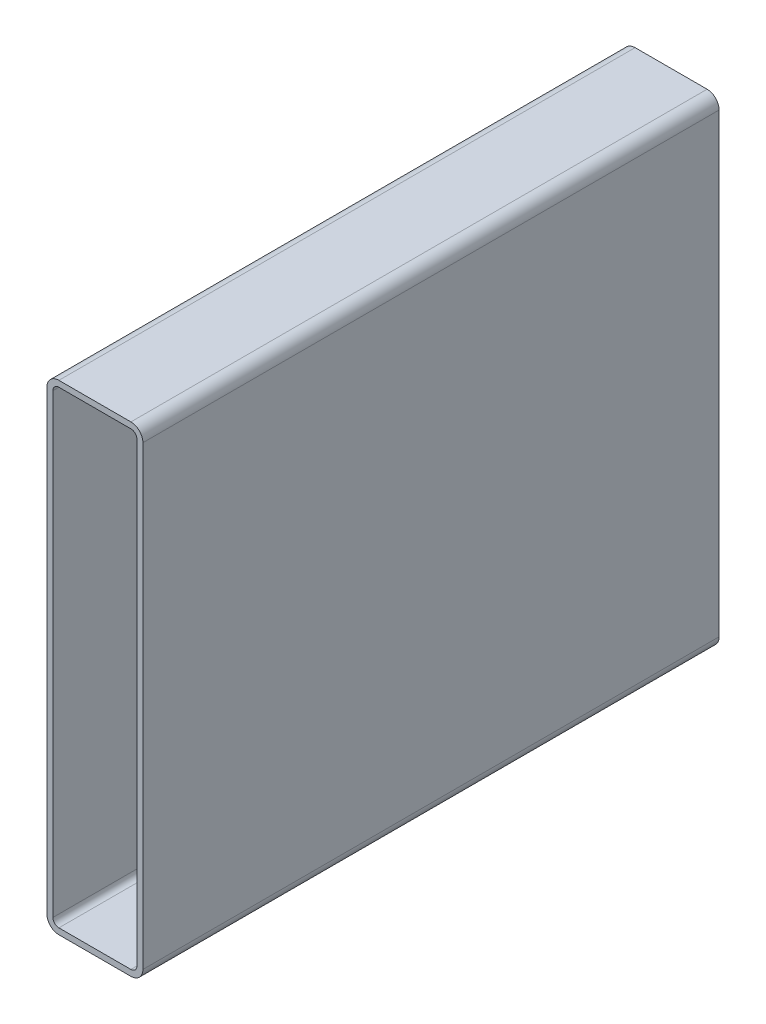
ISO-10303-21;
HEADER;
FILE_DESCRIPTION(('STEP AP214'),'2;1');
FILE_NAME('part.step','',(''),(''),'','','');
FILE_SCHEMA(('AUTOMOTIVE_DESIGN { 1 0 10303 214 1 1 1 1 }'));
ENDSEC;
DATA;
#1=APPLICATION_CONTEXT('core data for automotive mechanical design processes');
#2=APPLICATION_PROTOCOL_DEFINITION('international standard','automotive_design',2000,#1);
#3=PRODUCT_CONTEXT('',#1,'mechanical');
#4=PRODUCT('Part','Part','',(#3));
#5=PRODUCT_RELATED_PRODUCT_CATEGORY('part','',(#4));
#6=PRODUCT_DEFINITION_FORMATION('','',#4);
#7=PRODUCT_DEFINITION_CONTEXT('part definition',#1,'design');
#8=PRODUCT_DEFINITION('design','',#6,#7);
#9=PRODUCT_DEFINITION_SHAPE('','',#8);
#10=(LENGTH_UNIT() NAMED_UNIT(*) SI_UNIT(.MILLI.,.METRE.));
#11=(NAMED_UNIT(*) PLANE_ANGLE_UNIT() SI_UNIT($,.RADIAN.));
#12=(NAMED_UNIT(*) SI_UNIT($,.STERADIAN.) SOLID_ANGLE_UNIT());
#13=UNCERTAINTY_MEASURE_WITH_UNIT(LENGTH_MEASURE(1.E-05),#10,'distance_accuracy_value','');
#14=(GEOMETRIC_REPRESENTATION_CONTEXT(3) GLOBAL_UNCERTAINTY_ASSIGNED_CONTEXT((#13)) GLOBAL_UNIT_ASSIGNED_CONTEXT((#10,
#11,#12)) REPRESENTATION_CONTEXT('',''));
#15=CARTESIAN_POINT('',(0.,0.,0.));
#16=DIRECTION('',(0.,0.,1.));
#17=DIRECTION('',(1.,0.,0.));
#18=AXIS2_PLACEMENT_3D('',#15,#16,#17);
#19=CARTESIAN_POINT('',(6.35,247.65,304.8));
#20=DIRECTION('',(0.,0.,1.));
#21=DIRECTION('',(1.,0.,0.));
#22=AXIS2_PLACEMENT_3D('',#19,#20,#21);
#23=PLANE('',#22);
#24=CARTESIAN_POINT('',(6.35,247.65,304.8));
#25=DIRECTION('',(0.,0.,1.));
#26=DIRECTION('',(1.,0.,0.));
#27=AXIS2_PLACEMENT_3D('',#24,#25,#26);
#28=CIRCLE('',#27,6.35000000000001);
#29=CARTESIAN_POINT('',(6.35,254.,304.8));
#30=VERTEX_POINT('',#29);
#31=CARTESIAN_POINT('',(0.,247.65,304.8));
#32=VERTEX_POINT('',#31);
#33=EDGE_CURVE('E211',#30,#32,#28,.T.);
#34=ORIENTED_EDGE('',*,*,#33,.T.);
#35=DIRECTION('',(0.,-1.,0.));
#36=VECTOR('',#35,1.);
#37=CARTESIAN_POINT('',(0.,6.35,304.8));
#38=LINE('',#37,#36);
#39=CARTESIAN_POINT('',(0.,6.35,304.8));
#40=VERTEX_POINT('',#39);
#41=EDGE_CURVE('E214',#32,#40,#38,.T.);
#42=ORIENTED_EDGE('',*,*,#41,.T.);
#43=CARTESIAN_POINT('',(6.35,6.35,304.8));
#44=DIRECTION('',(0.,0.,1.));
#45=DIRECTION('',(1.,0.,0.));
#46=AXIS2_PLACEMENT_3D('',#43,#44,#45);
#47=CIRCLE('',#46,6.35);
#48=CARTESIAN_POINT('',(6.35,0.,304.8));
#49=VERTEX_POINT('',#48);
#50=EDGE_CURVE('E217',#40,#49,#47,.T.);
#51=ORIENTED_EDGE('',*,*,#50,.T.);
#52=DIRECTION('',(1.,0.,0.));
#53=VECTOR('',#52,1.);
#54=CARTESIAN_POINT('',(44.45,0.,304.8));
#55=LINE('',#54,#53);
#56=CARTESIAN_POINT('',(44.45,0.,304.8));
#57=VERTEX_POINT('',#56);
#58=EDGE_CURVE('E219',#49,#57,#55,.T.);
#59=ORIENTED_EDGE('',*,*,#58,.T.);
#60=CARTESIAN_POINT('',(44.45,6.35,304.8));
#61=DIRECTION('',(0.,0.,1.));
#62=DIRECTION('',(1.,0.,0.));
#63=AXIS2_PLACEMENT_3D('',#60,#61,#62);
#64=CIRCLE('',#63,6.35);
#65=CARTESIAN_POINT('',(50.8,6.35,304.8));
#66=VERTEX_POINT('',#65);
#67=EDGE_CURVE('E221',#57,#66,#64,.T.);
#68=ORIENTED_EDGE('',*,*,#67,.T.);
#69=DIRECTION('',(0.,1.,0.));
#70=VECTOR('',#69,1.);
#71=CARTESIAN_POINT('',(50.8,247.65,304.8));
#72=LINE('',#71,#70);
#73=CARTESIAN_POINT('',(50.8,247.65,304.8));
#74=VERTEX_POINT('',#73);
#75=EDGE_CURVE('E223',#66,#74,#72,.T.);
#76=ORIENTED_EDGE('',*,*,#75,.T.);
#77=CARTESIAN_POINT('',(44.45,247.65,304.8));
#78=DIRECTION('',(0.,0.,1.));
#79=DIRECTION('',(1.,0.,0.));
#80=AXIS2_PLACEMENT_3D('',#77,#78,#79);
#81=CIRCLE('',#80,6.35000000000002);
#82=CARTESIAN_POINT('',(44.45,254.,304.8));
#83=VERTEX_POINT('',#82);
#84=EDGE_CURVE('E225',#74,#83,#81,.T.);
#85=ORIENTED_EDGE('',*,*,#84,.T.);
#86=DIRECTION('',(-1.,0.,0.));
#87=VECTOR('',#86,1.);
#88=CARTESIAN_POINT('',(6.35,254.,304.8));
#89=LINE('',#88,#87);
#90=EDGE_CURVE('E227',#83,#30,#89,.T.);
#91=ORIENTED_EDGE('',*,*,#90,.T.);
#92=EDGE_LOOP('',(#34,#42,#51,#59,#68,#76,#85,#91));
#93=FACE_BOUND('',#92,.T.);
#94=DIRECTION('',(0.,-1.,0.));
#95=VECTOR('',#94,1.);
#96=CARTESIAN_POINT('',(3.175,6.35,304.8));
#97=LINE('',#96,#95);
#98=CARTESIAN_POINT('',(3.175,247.65,304.8));
#99=VERTEX_POINT('',#98);
#100=CARTESIAN_POINT('',(3.175,6.35,304.8));
#101=VERTEX_POINT('',#100);
#102=EDGE_CURVE('E154',#99,#101,#97,.T.);
#103=ORIENTED_EDGE('',*,*,#102,.F.);
#104=CARTESIAN_POINT('',(6.35,247.65,304.8));
#105=DIRECTION('',(0.,0.,1.));
#106=DIRECTION('',(1.,0.,0.));
#107=AXIS2_PLACEMENT_3D('',#104,#105,#106);
#108=CIRCLE('',#107,3.17499999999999);
#109=CARTESIAN_POINT('',(6.35,250.825,304.8));
#110=VERTEX_POINT('',#109);
#111=EDGE_CURVE('E146',#110,#99,#108,.T.);
#112=ORIENTED_EDGE('',*,*,#111,.F.);
#113=DIRECTION('',(-1.,0.,0.));
#114=VECTOR('',#113,1.);
#115=CARTESIAN_POINT('',(6.35,250.825,304.8));
#116=LINE('',#115,#114);
#117=CARTESIAN_POINT('',(44.45,250.825,304.8));
#118=VERTEX_POINT('',#117);
#119=EDGE_CURVE('E179',#118,#110,#116,.T.);
#120=ORIENTED_EDGE('',*,*,#119,.F.);
#121=CARTESIAN_POINT('',(44.45,247.65,304.8));
#122=DIRECTION('',(0.,0.,1.));
#123=DIRECTION('',(1.,0.,0.));
#124=AXIS2_PLACEMENT_3D('',#121,#122,#123);
#125=CIRCLE('',#124,3.17499999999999);
#126=CARTESIAN_POINT('',(47.625,247.65,304.8));
#127=VERTEX_POINT('',#126);
#128=EDGE_CURVE('E177',#127,#118,#125,.T.);
#129=ORIENTED_EDGE('',*,*,#128,.F.);
#130=DIRECTION('',(0.,1.,0.));
#131=VECTOR('',#130,1.);
#132=CARTESIAN_POINT('',(47.625,247.65,304.8));
#133=LINE('',#132,#131);
#134=CARTESIAN_POINT('',(47.625,6.35,304.8));
#135=VERTEX_POINT('',#134);
#136=EDGE_CURVE('E175',#135,#127,#133,.T.);
#137=ORIENTED_EDGE('',*,*,#136,.F.);
#138=CARTESIAN_POINT('',(44.45,6.35,304.8));
#139=DIRECTION('',(0.,0.,1.));
#140=DIRECTION('',(1.,0.,0.));
#141=AXIS2_PLACEMENT_3D('',#138,#139,#140);
#142=CIRCLE('',#141,3.175);
#143=CARTESIAN_POINT('',(44.45,3.175,304.8));
#144=VERTEX_POINT('',#143);
#145=EDGE_CURVE('E173',#144,#135,#142,.T.);
#146=ORIENTED_EDGE('',*,*,#145,.F.);
#147=DIRECTION('',(1.,0.,0.));
#148=VECTOR('',#147,1.);
#149=CARTESIAN_POINT('',(44.45,3.175,304.8));
#150=LINE('',#149,#148);
#151=CARTESIAN_POINT('',(6.35,3.175,304.8));
#152=VERTEX_POINT('',#151);
#153=EDGE_CURVE('E169',#152,#144,#150,.T.);
#154=ORIENTED_EDGE('',*,*,#153,.F.);
#155=CARTESIAN_POINT('',(6.35,6.35,304.8));
#156=DIRECTION('',(0.,0.,1.));
#157=DIRECTION('',(1.,0.,0.));
#158=AXIS2_PLACEMENT_3D('',#155,#156,#157);
#159=CIRCLE('',#158,3.175);
#160=EDGE_CURVE('E167',#101,#152,#159,.T.);
#161=ORIENTED_EDGE('',*,*,#160,.F.);
#162=EDGE_LOOP('',(#103,#112,#120,#129,#137,#146,#154,#161));
#163=FACE_BOUND('',#162,.T.);
#164=ADVANCED_FACE('F33',(#93,#163),#23,.T.);
#165=CARTESIAN_POINT('',(6.35,247.65,0.));
#166=DIRECTION('',(0.,0.,1.));
#167=DIRECTION('',(1.,0.,0.));
#168=AXIS2_PLACEMENT_3D('',#165,#166,#167);
#169=PLANE('',#168);
#170=CARTESIAN_POINT('',(6.35,247.65,0.));
#171=DIRECTION('',(0.,0.,1.));
#172=DIRECTION('',(1.,0.,0.));
#173=AXIS2_PLACEMENT_3D('',#170,#171,#172);
#174=CIRCLE('',#173,6.35000000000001);
#175=CARTESIAN_POINT('',(6.35,254.,0.));
#176=VERTEX_POINT('',#175);
#177=CARTESIAN_POINT('',(0.,247.65,0.));
#178=VERTEX_POINT('',#177);
#179=EDGE_CURVE('E162',#176,#178,#174,.T.);
#180=ORIENTED_EDGE('',*,*,#179,.F.);
#181=DIRECTION('',(-1.,0.,0.));
#182=VECTOR('',#181,1.);
#183=CARTESIAN_POINT('',(6.35,254.,0.));
#184=LINE('',#183,#182);
#185=CARTESIAN_POINT('',(44.45,254.,0.));
#186=VERTEX_POINT('',#185);
#187=EDGE_CURVE('E215',#186,#176,#184,.T.);
#188=ORIENTED_EDGE('',*,*,#187,.F.);
#189=CARTESIAN_POINT('',(44.45,247.65,0.));
#190=DIRECTION('',(0.,0.,1.));
#191=DIRECTION('',(1.,0.,0.));
#192=AXIS2_PLACEMENT_3D('',#189,#190,#191);
#193=CIRCLE('',#192,6.35000000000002);
#194=CARTESIAN_POINT('',(50.8,247.65,0.));
#195=VERTEX_POINT('',#194);
#196=EDGE_CURVE('E242',#195,#186,#193,.T.);
#197=ORIENTED_EDGE('',*,*,#196,.F.);
#198=DIRECTION('',(0.,1.,0.));
#199=VECTOR('',#198,1.);
#200=CARTESIAN_POINT('',(50.8,247.65,0.));
#201=LINE('',#200,#199);
#202=CARTESIAN_POINT('',(50.8,6.35,0.));
#203=VERTEX_POINT('',#202);
#204=EDGE_CURVE('E240',#203,#195,#201,.T.);
#205=ORIENTED_EDGE('',*,*,#204,.F.);
#206=CARTESIAN_POINT('',(44.45,6.35,0.));
#207=DIRECTION('',(0.,0.,1.));
#208=DIRECTION('',(1.,0.,0.));
#209=AXIS2_PLACEMENT_3D('',#206,#207,#208);
#210=CIRCLE('',#209,6.35);
#211=CARTESIAN_POINT('',(44.45,0.,0.));
#212=VERTEX_POINT('',#211);
#213=EDGE_CURVE('E238',#212,#203,#210,.T.);
#214=ORIENTED_EDGE('',*,*,#213,.F.);
#215=DIRECTION('',(1.,0.,0.));
#216=VECTOR('',#215,1.);
#217=CARTESIAN_POINT('',(44.45,0.,0.));
#218=LINE('',#217,#216);
#219=CARTESIAN_POINT('',(6.35,0.,0.));
#220=VERTEX_POINT('',#219);
#221=EDGE_CURVE('E236',#220,#212,#218,.T.);
#222=ORIENTED_EDGE('',*,*,#221,.F.);
#223=CARTESIAN_POINT('',(6.35,6.35,0.));
#224=DIRECTION('',(0.,0.,1.));
#225=DIRECTION('',(1.,0.,0.));
#226=AXIS2_PLACEMENT_3D('',#223,#224,#225);
#227=CIRCLE('',#226,6.35);
#228=CARTESIAN_POINT('',(0.,6.35,0.));
#229=VERTEX_POINT('',#228);
#230=EDGE_CURVE('E234',#229,#220,#227,.T.);
#231=ORIENTED_EDGE('',*,*,#230,.F.);
#232=DIRECTION('',(0.,-1.,0.));
#233=VECTOR('',#232,1.);
#234=CARTESIAN_POINT('',(0.,6.35,0.));
#235=LINE('',#234,#233);
#236=EDGE_CURVE('E232',#178,#229,#235,.T.);
#237=ORIENTED_EDGE('',*,*,#236,.F.);
#238=EDGE_LOOP('',(#180,#188,#197,#205,#214,#222,#231,#237));
#239=FACE_BOUND('',#238,.T.);
#240=CARTESIAN_POINT('',(6.35,247.65,0.));
#241=DIRECTION('',(0.,0.,1.));
#242=DIRECTION('',(1.,0.,0.));
#243=AXIS2_PLACEMENT_3D('',#240,#241,#242);
#244=CIRCLE('',#243,3.17499999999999);
#245=CARTESIAN_POINT('',(6.35,250.825,0.));
#246=VERTEX_POINT('',#245);
#247=CARTESIAN_POINT('',(3.175,247.65,0.));
#248=VERTEX_POINT('',#247);
#249=EDGE_CURVE('E56',#246,#248,#244,.T.);
#250=ORIENTED_EDGE('',*,*,#249,.T.);
#251=DIRECTION('',(0.,-1.,0.));
#252=VECTOR('',#251,1.);
#253=CARTESIAN_POINT('',(3.175,6.35,0.));
#254=LINE('',#253,#252);
#255=CARTESIAN_POINT('',(3.175,6.35,0.));
#256=VERTEX_POINT('',#255);
#257=EDGE_CURVE('E161',#248,#256,#254,.T.);
#258=ORIENTED_EDGE('',*,*,#257,.T.);
#259=CARTESIAN_POINT('',(6.35,6.35,0.));
#260=DIRECTION('',(0.,0.,1.));
#261=DIRECTION('',(1.,0.,0.));
#262=AXIS2_PLACEMENT_3D('',#259,#260,#261);
#263=CIRCLE('',#262,3.175);
#264=CARTESIAN_POINT('',(6.35,3.175,0.));
#265=VERTEX_POINT('',#264);
#266=EDGE_CURVE('E183',#256,#265,#263,.T.);
#267=ORIENTED_EDGE('',*,*,#266,.T.);
#268=DIRECTION('',(1.,0.,0.));
#269=VECTOR('',#268,1.);
#270=CARTESIAN_POINT('',(44.45,3.175,0.));
#271=LINE('',#270,#269);
#272=CARTESIAN_POINT('',(44.45,3.175,0.));
#273=VERTEX_POINT('',#272);
#274=EDGE_CURVE('E186',#265,#273,#271,.T.);
#275=ORIENTED_EDGE('',*,*,#274,.T.);
#276=CARTESIAN_POINT('',(44.45,6.35,0.));
#277=DIRECTION('',(0.,0.,1.));
#278=DIRECTION('',(1.,0.,0.));
#279=AXIS2_PLACEMENT_3D('',#276,#277,#278);
#280=CIRCLE('',#279,3.175);
#281=CARTESIAN_POINT('',(47.625,6.35,0.));
#282=VERTEX_POINT('',#281);
#283=EDGE_CURVE('E189',#273,#282,#280,.T.);
#284=ORIENTED_EDGE('',*,*,#283,.T.);
#285=DIRECTION('',(0.,1.,0.));
#286=VECTOR('',#285,1.);
#287=CARTESIAN_POINT('',(47.625,247.65,0.));
#288=LINE('',#287,#286);
#289=CARTESIAN_POINT('',(47.625,247.65,0.));
#290=VERTEX_POINT('',#289);
#291=EDGE_CURVE('E192',#282,#290,#288,.T.);
#292=ORIENTED_EDGE('',*,*,#291,.T.);
#293=CARTESIAN_POINT('',(44.45,247.65,0.));
#294=DIRECTION('',(0.,0.,1.));
#295=DIRECTION('',(1.,0.,0.));
#296=AXIS2_PLACEMENT_3D('',#293,#294,#295);
#297=CIRCLE('',#296,3.17499999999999);
#298=CARTESIAN_POINT('',(44.45,250.825,0.));
#299=VERTEX_POINT('',#298);
#300=EDGE_CURVE('E195',#290,#299,#297,.T.);
#301=ORIENTED_EDGE('',*,*,#300,.T.);
#302=DIRECTION('',(-1.,0.,0.));
#303=VECTOR('',#302,1.);
#304=CARTESIAN_POINT('',(6.35,250.825,0.));
#305=LINE('',#304,#303);
#306=EDGE_CURVE('E155',#299,#246,#305,.T.);
#307=ORIENTED_EDGE('',*,*,#306,.T.);
#308=EDGE_LOOP('',(#250,#258,#267,#275,#284,#292,#301,#307));
#309=FACE_BOUND('',#308,.T.);
#310=ADVANCED_FACE('F272',(#239,#309),#169,.F.);
#311=CARTESIAN_POINT('',(6.35,247.65,304.8));
#312=DIRECTION('',(0.,0.,-1.));
#313=DIRECTION('',(-1.,0.,0.));
#314=AXIS2_PLACEMENT_3D('',#311,#312,#313);
#315=CYLINDRICAL_SURFACE('',#314,6.35000000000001);
#316=ORIENTED_EDGE('',*,*,#179,.T.);
#317=DIRECTION('',(0.,0.,-1.));
#318=VECTOR('',#317,1.);
#319=CARTESIAN_POINT('',(0.,247.65,304.8));
#320=LINE('',#319,#318);
#321=EDGE_CURVE('E11',#32,#178,#320,.T.);
#322=ORIENTED_EDGE('',*,*,#321,.F.);
#323=ORIENTED_EDGE('',*,*,#33,.F.);
#324=DIRECTION('',(0.,0.,-1.));
#325=VECTOR('',#324,1.);
#326=CARTESIAN_POINT('',(6.35,254.,304.8));
#327=LINE('',#326,#325);
#328=EDGE_CURVE('E229',#30,#176,#327,.T.);
#329=ORIENTED_EDGE('',*,*,#328,.T.);
#330=EDGE_LOOP('',(#316,#322,#323,#329));
#331=FACE_BOUND('',#330,.T.);
#332=ADVANCED_FACE('F35',(#331),#315,.T.);
#333=CARTESIAN_POINT('',(0.,6.35,304.8));
#334=DIRECTION('',(1.,0.,0.));
#335=DIRECTION('',(0.,0.,-1.));
#336=AXIS2_PLACEMENT_3D('',#333,#334,#335);
#337=PLANE('',#336);
#338=ORIENTED_EDGE('',*,*,#236,.T.);
#339=DIRECTION('',(0.,0.,-1.));
#340=VECTOR('',#339,1.);
#341=CARTESIAN_POINT('',(0.,6.35,304.8));
#342=LINE('',#341,#340);
#343=EDGE_CURVE('E41',#40,#229,#342,.T.);
#344=ORIENTED_EDGE('',*,*,#343,.F.);
#345=ORIENTED_EDGE('',*,*,#41,.F.);
#346=ORIENTED_EDGE('',*,*,#321,.T.);
#347=EDGE_LOOP('',(#338,#344,#345,#346));
#348=FACE_BOUND('',#347,.T.);
#349=ADVANCED_FACE('F289',(#348),#337,.F.);
#350=CARTESIAN_POINT('',(6.35,6.35,304.8));
#351=DIRECTION('',(0.,0.,-1.));
#352=DIRECTION('',(-1.,0.,0.));
#353=AXIS2_PLACEMENT_3D('',#350,#351,#352);
#354=CYLINDRICAL_SURFACE('',#353,6.35);
#355=ORIENTED_EDGE('',*,*,#230,.T.);
#356=DIRECTION('',(0.,0.,-1.));
#357=VECTOR('',#356,1.);
#358=CARTESIAN_POINT('',(6.35,0.,304.8));
#359=LINE('',#358,#357);
#360=EDGE_CURVE('E259',#49,#220,#359,.T.);
#361=ORIENTED_EDGE('',*,*,#360,.F.);
#362=ORIENTED_EDGE('',*,*,#50,.F.);
#363=ORIENTED_EDGE('',*,*,#343,.T.);
#364=EDGE_LOOP('',(#355,#361,#362,#363));
#365=FACE_BOUND('',#364,.T.);
#366=ADVANCED_FACE('F266',(#365),#354,.T.);
#367=CARTESIAN_POINT('',(44.45,0.,304.8));
#368=DIRECTION('',(0.,1.,0.));
#369=DIRECTION('',(0.,0.,1.));
#370=AXIS2_PLACEMENT_3D('',#367,#368,#369);
#371=PLANE('',#370);
#372=ORIENTED_EDGE('',*,*,#221,.T.);
#373=DIRECTION('',(0.,0.,-1.));
#374=VECTOR('',#373,1.);
#375=CARTESIAN_POINT('',(44.45,0.,304.8));
#376=LINE('',#375,#374);
#377=EDGE_CURVE('E256',#57,#212,#376,.T.);
#378=ORIENTED_EDGE('',*,*,#377,.F.);
#379=ORIENTED_EDGE('',*,*,#58,.F.);
#380=ORIENTED_EDGE('',*,*,#360,.T.);
#381=EDGE_LOOP('',(#372,#378,#379,#380));
#382=FACE_BOUND('',#381,.T.);
#383=ADVANCED_FACE('F278',(#382),#371,.F.);
#384=CARTESIAN_POINT('',(44.45,6.35,304.8));
#385=DIRECTION('',(0.,0.,-1.));
#386=DIRECTION('',(-1.,0.,0.));
#387=AXIS2_PLACEMENT_3D('',#384,#385,#386);
#388=CYLINDRICAL_SURFACE('',#387,6.35);
#389=ORIENTED_EDGE('',*,*,#213,.T.);
#390=DIRECTION('',(0.,0.,-1.));
#391=VECTOR('',#390,1.);
#392=CARTESIAN_POINT('',(50.8,6.35,304.8));
#393=LINE('',#392,#391);
#394=EDGE_CURVE('E253',#66,#203,#393,.T.);
#395=ORIENTED_EDGE('',*,*,#394,.F.);
#396=ORIENTED_EDGE('',*,*,#67,.F.);
#397=ORIENTED_EDGE('',*,*,#377,.T.);
#398=EDGE_LOOP('',(#389,#395,#396,#397));
#399=FACE_BOUND('',#398,.T.);
#400=ADVANCED_FACE('F282',(#399),#388,.T.);
#401=CARTESIAN_POINT('',(50.8,247.65,304.8));
#402=DIRECTION('',(-1.,0.,0.));
#403=DIRECTION('',(0.,0.,1.));
#404=AXIS2_PLACEMENT_3D('',#401,#402,#403);
#405=PLANE('',#404);
#406=ORIENTED_EDGE('',*,*,#204,.T.);
#407=DIRECTION('',(0.,0.,-1.));
#408=VECTOR('',#407,1.);
#409=CARTESIAN_POINT('',(50.8,247.65,304.8));
#410=LINE('',#409,#408);
#411=EDGE_CURVE('E250',#74,#195,#410,.T.);
#412=ORIENTED_EDGE('',*,*,#411,.F.);
#413=ORIENTED_EDGE('',*,*,#75,.F.);
#414=ORIENTED_EDGE('',*,*,#394,.T.);
#415=EDGE_LOOP('',(#406,#412,#413,#414));
#416=FACE_BOUND('',#415,.T.);
#417=ADVANCED_FACE('F302',(#416),#405,.F.);
#418=CARTESIAN_POINT('',(44.45,247.65,304.8));
#419=DIRECTION('',(0.,0.,-1.));
#420=DIRECTION('',(-1.,0.,0.));
#421=AXIS2_PLACEMENT_3D('',#418,#419,#420);
#422=CYLINDRICAL_SURFACE('',#421,6.35000000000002);
#423=ORIENTED_EDGE('',*,*,#196,.T.);
#424=DIRECTION('',(0.,0.,-1.));
#425=VECTOR('',#424,1.);
#426=CARTESIAN_POINT('',(44.45,254.,304.8));
#427=LINE('',#426,#425);
#428=EDGE_CURVE('E247',#83,#186,#427,.T.);
#429=ORIENTED_EDGE('',*,*,#428,.F.);
#430=ORIENTED_EDGE('',*,*,#84,.F.);
#431=ORIENTED_EDGE('',*,*,#411,.T.);
#432=EDGE_LOOP('',(#423,#429,#430,#431));
#433=FACE_BOUND('',#432,.T.);
#434=ADVANCED_FACE('F300',(#433),#422,.T.);
#435=CARTESIAN_POINT('',(6.35,254.,304.8));
#436=DIRECTION('',(0.,-1.,0.));
#437=DIRECTION('',(0.,0.,-1.));
#438=AXIS2_PLACEMENT_3D('',#435,#436,#437);
#439=PLANE('',#438);
#440=ORIENTED_EDGE('',*,*,#187,.T.);
#441=ORIENTED_EDGE('',*,*,#328,.F.);
#442=ORIENTED_EDGE('',*,*,#90,.F.);
#443=ORIENTED_EDGE('',*,*,#428,.T.);
#444=EDGE_LOOP('',(#440,#441,#442,#443));
#445=FACE_BOUND('',#444,.T.);
#446=ADVANCED_FACE('F295',(#445),#439,.F.);
#447=CARTESIAN_POINT('',(6.35,247.65,304.8));
#448=DIRECTION('',(0.,0.,-1.));
#449=DIRECTION('',(-1.,0.,0.));
#450=AXIS2_PLACEMENT_3D('',#447,#448,#449);
#451=CYLINDRICAL_SURFACE('',#450,3.17499999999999);
#452=ORIENTED_EDGE('',*,*,#249,.F.);
#453=DIRECTION('',(0.,0.,-1.));
#454=VECTOR('',#453,1.);
#455=CARTESIAN_POINT('',(6.35,250.825,304.8));
#456=LINE('',#455,#454);
#457=EDGE_CURVE('E150',#110,#246,#456,.T.);
#458=ORIENTED_EDGE('',*,*,#457,.F.);
#459=ORIENTED_EDGE('',*,*,#111,.T.);
#460=DIRECTION('',(0.,0.,-1.));
#461=VECTOR('',#460,1.);
#462=CARTESIAN_POINT('',(3.175,247.65,304.8));
#463=LINE('',#462,#461);
#464=EDGE_CURVE('E149',#99,#248,#463,.T.);
#465=ORIENTED_EDGE('',*,*,#464,.T.);
#466=EDGE_LOOP('',(#452,#458,#459,#465));
#467=FACE_BOUND('',#466,.T.);
#468=ADVANCED_FACE('F148',(#467),#451,.F.);
#469=CARTESIAN_POINT('',(3.175,6.35,304.8));
#470=DIRECTION('',(1.,0.,0.));
#471=DIRECTION('',(0.,0.,-1.));
#472=AXIS2_PLACEMENT_3D('',#469,#470,#471);
#473=PLANE('',#472);
#474=ORIENTED_EDGE('',*,*,#257,.F.);
#475=ORIENTED_EDGE('',*,*,#464,.F.);
#476=ORIENTED_EDGE('',*,*,#102,.T.);
#477=DIRECTION('',(0.,0.,-1.));
#478=VECTOR('',#477,1.);
#479=CARTESIAN_POINT('',(3.175,6.35,304.8));
#480=LINE('',#479,#478);
#481=EDGE_CURVE('E163',#101,#256,#480,.T.);
#482=ORIENTED_EDGE('',*,*,#481,.T.);
#483=EDGE_LOOP('',(#474,#475,#476,#482));
#484=FACE_BOUND('',#483,.T.);
#485=ADVANCED_FACE('F158',(#484),#473,.T.);
#486=CARTESIAN_POINT('',(6.35,6.35,304.8));
#487=DIRECTION('',(0.,0.,-1.));
#488=DIRECTION('',(-1.,0.,0.));
#489=AXIS2_PLACEMENT_3D('',#486,#487,#488);
#490=CYLINDRICAL_SURFACE('',#489,3.175);
#491=ORIENTED_EDGE('',*,*,#266,.F.);
#492=ORIENTED_EDGE('',*,*,#481,.F.);
#493=ORIENTED_EDGE('',*,*,#160,.T.);
#494=DIRECTION('',(0.,0.,-1.));
#495=VECTOR('',#494,1.);
#496=CARTESIAN_POINT('',(6.35,3.175,304.8));
#497=LINE('',#496,#495);
#498=EDGE_CURVE('E208',#152,#265,#497,.T.);
#499=ORIENTED_EDGE('',*,*,#498,.T.);
#500=EDGE_LOOP('',(#491,#492,#493,#499));
#501=FACE_BOUND('',#500,.T.);
#502=ADVANCED_FACE('F327',(#501),#490,.F.);
#503=CARTESIAN_POINT('',(44.45,3.175,304.8));
#504=DIRECTION('',(0.,1.,0.));
#505=DIRECTION('',(0.,0.,1.));
#506=AXIS2_PLACEMENT_3D('',#503,#504,#505);
#507=PLANE('',#506);
#508=ORIENTED_EDGE('',*,*,#274,.F.);
#509=ORIENTED_EDGE('',*,*,#498,.F.);
#510=ORIENTED_EDGE('',*,*,#153,.T.);
#511=DIRECTION('',(0.,0.,-1.));
#512=VECTOR('',#511,1.);
#513=CARTESIAN_POINT('',(44.45,3.175,304.8));
#514=LINE('',#513,#512);
#515=EDGE_CURVE('E206',#144,#273,#514,.T.);
#516=ORIENTED_EDGE('',*,*,#515,.T.);
#517=EDGE_LOOP('',(#508,#509,#510,#516));
#518=FACE_BOUND('',#517,.T.);
#519=ADVANCED_FACE('F331',(#518),#507,.T.);
#520=CARTESIAN_POINT('',(44.45,6.35,304.8));
#521=DIRECTION('',(0.,0.,-1.));
#522=DIRECTION('',(-1.,0.,0.));
#523=AXIS2_PLACEMENT_3D('',#520,#521,#522);
#524=CYLINDRICAL_SURFACE('',#523,3.175);
#525=ORIENTED_EDGE('',*,*,#283,.F.);
#526=ORIENTED_EDGE('',*,*,#515,.F.);
#527=ORIENTED_EDGE('',*,*,#145,.T.);
#528=DIRECTION('',(0.,0.,-1.));
#529=VECTOR('',#528,1.);
#530=CARTESIAN_POINT('',(47.625,6.35,304.8));
#531=LINE('',#530,#529);
#532=EDGE_CURVE('E204',#135,#282,#531,.T.);
#533=ORIENTED_EDGE('',*,*,#532,.T.);
#534=EDGE_LOOP('',(#525,#526,#527,#533));
#535=FACE_BOUND('',#534,.T.);
#536=ADVANCED_FACE('F337',(#535),#524,.F.);
#537=CARTESIAN_POINT('',(47.625,247.65,304.8));
#538=DIRECTION('',(-1.,0.,0.));
#539=DIRECTION('',(0.,0.,1.));
#540=AXIS2_PLACEMENT_3D('',#537,#538,#539);
#541=PLANE('',#540);
#542=ORIENTED_EDGE('',*,*,#291,.F.);
#543=ORIENTED_EDGE('',*,*,#532,.F.);
#544=ORIENTED_EDGE('',*,*,#136,.T.);
#545=DIRECTION('',(0.,0.,-1.));
#546=VECTOR('',#545,1.);
#547=CARTESIAN_POINT('',(47.625,247.65,304.8));
#548=LINE('',#547,#546);
#549=EDGE_CURVE('E202',#127,#290,#548,.T.);
#550=ORIENTED_EDGE('',*,*,#549,.T.);
#551=EDGE_LOOP('',(#542,#543,#544,#550));
#552=FACE_BOUND('',#551,.T.);
#553=ADVANCED_FACE('F341',(#552),#541,.T.);
#554=CARTESIAN_POINT('',(44.45,247.65,304.8));
#555=DIRECTION('',(0.,0.,-1.));
#556=DIRECTION('',(-1.,0.,0.));
#557=AXIS2_PLACEMENT_3D('',#554,#555,#556);
#558=CYLINDRICAL_SURFACE('',#557,3.17499999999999);
#559=ORIENTED_EDGE('',*,*,#300,.F.);
#560=ORIENTED_EDGE('',*,*,#549,.F.);
#561=ORIENTED_EDGE('',*,*,#128,.T.);
#562=DIRECTION('',(0.,0.,-1.));
#563=VECTOR('',#562,1.);
#564=CARTESIAN_POINT('',(44.45,250.825,304.8));
#565=LINE('',#564,#563);
#566=EDGE_CURVE('E48',#118,#299,#565,.T.);
#567=ORIENTED_EDGE('',*,*,#566,.T.);
#568=EDGE_LOOP('',(#559,#560,#561,#567));
#569=FACE_BOUND('',#568,.T.);
#570=ADVANCED_FACE('F345',(#569),#558,.F.);
#571=CARTESIAN_POINT('',(6.35,250.825,304.8));
#572=DIRECTION('',(0.,-1.,0.));
#573=DIRECTION('',(0.,0.,-1.));
#574=AXIS2_PLACEMENT_3D('',#571,#572,#573);
#575=PLANE('',#574);
#576=ORIENTED_EDGE('',*,*,#306,.F.);
#577=ORIENTED_EDGE('',*,*,#566,.F.);
#578=ORIENTED_EDGE('',*,*,#119,.T.);
#579=ORIENTED_EDGE('',*,*,#457,.T.);
#580=EDGE_LOOP('',(#576,#577,#578,#579));
#581=FACE_BOUND('',#580,.T.);
#582=ADVANCED_FACE('F349',(#581),#575,.T.);
#583=CLOSED_SHELL('',(#164,#310,#332,#349,#366,#383,#400,#417,#434,#446,#468,#485,#502,#519,
#536,#553,#570,#582));
#584=MANIFOLD_SOLID_BREP('B2',#583);
#585=ADVANCED_BREP_SHAPE_REPRESENTATION('',(#18,#584),#14);
#586=SHAPE_DEFINITION_REPRESENTATION(#9,#585);
ENDSEC;
END-ISO-10303-21;
